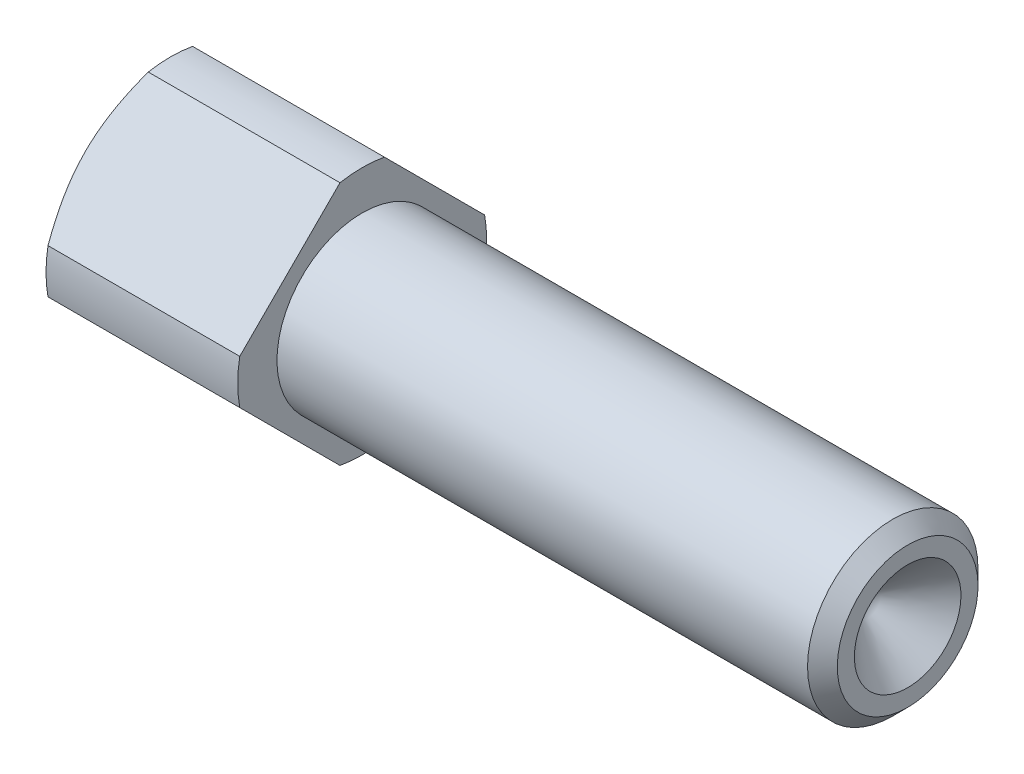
ISO-10303-21;
HEADER;
FILE_DESCRIPTION(('STEP AP214'),'2;1');
FILE_NAME('part.step','',(''),(''),'','','');
FILE_SCHEMA(('AUTOMOTIVE_DESIGN { 1 0 10303 214 1 1 1 1 }'));
ENDSEC;
DATA;
#1=APPLICATION_CONTEXT('core data for automotive mechanical design processes');
#2=APPLICATION_PROTOCOL_DEFINITION('international standard','automotive_design',2000,#1);
#3=PRODUCT_CONTEXT('',#1,'mechanical');
#4=PRODUCT('Part','Part','',(#3));
#5=PRODUCT_RELATED_PRODUCT_CATEGORY('part','',(#4));
#6=PRODUCT_DEFINITION_FORMATION('','',#4);
#7=PRODUCT_DEFINITION_CONTEXT('part definition',#1,'design');
#8=PRODUCT_DEFINITION('design','',#6,#7);
#9=PRODUCT_DEFINITION_SHAPE('','',#8);
#10=(LENGTH_UNIT() NAMED_UNIT(*) SI_UNIT(.MILLI.,.METRE.));
#11=(NAMED_UNIT(*) PLANE_ANGLE_UNIT() SI_UNIT($,.RADIAN.));
#12=(NAMED_UNIT(*) SI_UNIT($,.STERADIAN.) SOLID_ANGLE_UNIT());
#13=UNCERTAINTY_MEASURE_WITH_UNIT(LENGTH_MEASURE(1.E-05),#10,'distance_accuracy_value','');
#14=(GEOMETRIC_REPRESENTATION_CONTEXT(3) GLOBAL_UNCERTAINTY_ASSIGNED_CONTEXT((#13)) GLOBAL_UNIT_ASSIGNED_CONTEXT((#10,
#11,#12)) REPRESENTATION_CONTEXT('',''));
#15=CARTESIAN_POINT('',(0.,0.,0.));
#16=DIRECTION('',(0.,0.,1.));
#17=DIRECTION('',(1.,0.,0.));
#18=AXIS2_PLACEMENT_3D('',#15,#16,#17);
#19=CARTESIAN_POINT('',(6.,0.,0.));
#20=DIRECTION('',(1.,0.,0.));
#21=DIRECTION('',(0.,0.,-1.));
#22=AXIS2_PLACEMENT_3D('',#19,#20,#21);
#23=PLANE('',#22);
#24=CARTESIAN_POINT('',(6.,0.,0.));
#25=DIRECTION('',(1.,0.,0.));
#26=DIRECTION('',(0.,0.,-1.));
#27=AXIS2_PLACEMENT_3D('',#24,#25,#26);
#28=CIRCLE('',#27,3.65);
#29=CARTESIAN_POINT('',(6.,0.651201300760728,3.59143938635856));
#30=VERTEX_POINT('',#29);
#31=CARTESIAN_POINT('',(6.,-0.651201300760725,3.59143938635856));
#32=VERTEX_POINT('',#31);
#33=EDGE_CURVE('E268',#30,#32,#28,.T.);
#34=ORIENTED_EDGE('',*,*,#33,.T.);
#35=DIRECTION('',(0.,0.707106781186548,0.707106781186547));
#36=VECTOR('',#35,1.);
#37=CARTESIAN_POINT('',(6.,-4.24264068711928,0.));
#38=LINE('',#37,#36);
#39=CARTESIAN_POINT('',(6.,-3.59143938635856,0.651201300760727));
#40=VERTEX_POINT('',#39);
#41=EDGE_CURVE('E274',#40,#32,#38,.T.);
#42=ORIENTED_EDGE('',*,*,#41,.F.);
#43=CARTESIAN_POINT('',(6.,-3.59143938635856,-0.651201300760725));
#44=VERTEX_POINT('',#43);
#45=EDGE_CURVE('E264',#40,#44,#28,.T.);
#46=ORIENTED_EDGE('',*,*,#45,.T.);
#47=DIRECTION('',(0.,-0.707106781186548,0.707106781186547));
#48=VECTOR('',#47,1.);
#49=CARTESIAN_POINT('',(6.,0.,-4.24264068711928));
#50=LINE('',#49,#48);
#51=CARTESIAN_POINT('',(6.,-0.651201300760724,-3.59143938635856));
#52=VERTEX_POINT('',#51);
#53=EDGE_CURVE('E286',#52,#44,#50,.T.);
#54=ORIENTED_EDGE('',*,*,#53,.F.);
#55=CARTESIAN_POINT('',(6.,0.651201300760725,-3.59143938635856));
#56=VERTEX_POINT('',#55);
#57=EDGE_CURVE('E262',#52,#56,#28,.T.);
#58=ORIENTED_EDGE('',*,*,#57,.T.);
#59=DIRECTION('',(0.,-0.707106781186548,-0.707106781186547));
#60=VECTOR('',#59,1.);
#61=CARTESIAN_POINT('',(6.,4.24264068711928,0.));
#62=LINE('',#61,#60);
#63=CARTESIAN_POINT('',(6.,3.59143938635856,-0.651201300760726));
#64=VERTEX_POINT('',#63);
#65=EDGE_CURVE('E281',#64,#56,#62,.T.);
#66=ORIENTED_EDGE('',*,*,#65,.F.);
#67=CARTESIAN_POINT('',(6.,3.59143938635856,0.651201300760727));
#68=VERTEX_POINT('',#67);
#69=EDGE_CURVE('E241',#64,#68,#28,.T.);
#70=ORIENTED_EDGE('',*,*,#69,.T.);
#71=DIRECTION('',(0.,0.707106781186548,-0.707106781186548));
#72=VECTOR('',#71,1.);
#73=CARTESIAN_POINT('',(6.,0.,4.24264068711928));
#74=LINE('',#73,#72);
#75=EDGE_CURVE('E276',#30,#68,#74,.T.);
#76=ORIENTED_EDGE('',*,*,#75,.F.);
#77=EDGE_LOOP('',(#34,#42,#46,#54,#58,#66,#70,#76));
#78=FACE_BOUND('',#77,.T.);
#79=CARTESIAN_POINT('',(6.,0.,0.));
#80=DIRECTION('',(1.,0.,0.));
#81=DIRECTION('',(0.,1.,0.));
#82=AXIS2_PLACEMENT_3D('',#79,#80,#81);
#83=CIRCLE('',#82,2.5);
#84=CARTESIAN_POINT('',(6.,2.5,0.));
#85=VERTEX_POINT('',#84);
#86=EDGE_CURVE('E133',#85,#85,#83,.T.);
#87=ORIENTED_EDGE('',*,*,#86,.F.);
#88=EDGE_LOOP('',(#87));
#89=FACE_BOUND('',#88,.T.);
#90=ADVANCED_FACE('F44',(#78,#89),#23,.T.);
#91=CARTESIAN_POINT('',(6.,0.,0.));
#92=DIRECTION('',(-1.,0.,0.));
#93=DIRECTION('',(0.,0.,1.));
#94=AXIS2_PLACEMENT_3D('',#91,#92,#93);
#95=CYLINDRICAL_SURFACE('',#94,3.65);
#96=DIRECTION('',(-1.,0.,0.));
#97=VECTOR('',#96,1.);
#98=CARTESIAN_POINT('',(6.,0.651201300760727,3.59143938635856));
#99=LINE('',#98,#97);
#100=CARTESIAN_POINT('',(0.375277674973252,0.651201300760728,3.59143938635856));
#101=VERTEX_POINT('',#100);
#102=EDGE_CURVE('E250',#101,#30,#99,.F.);
#103=ORIENTED_EDGE('',*,*,#102,.F.);
#104=CARTESIAN_POINT('',(0.375277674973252,0.,0.));
#105=DIRECTION('',(1.,0.,0.));
#106=DIRECTION('',(0.,1.,0.));
#107=AXIS2_PLACEMENT_3D('',#104,#105,#106);
#108=CIRCLE('',#107,3.65);
#109=CARTESIAN_POINT('',(0.375277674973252,-0.651201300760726,3.59143938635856));
#110=VERTEX_POINT('',#109);
#111=EDGE_CURVE('E145',#101,#110,#108,.T.);
#112=ORIENTED_EDGE('',*,*,#111,.T.);
#113=DIRECTION('',(-1.,0.,0.));
#114=VECTOR('',#113,1.);
#115=CARTESIAN_POINT('',(6.,-0.651201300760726,3.59143938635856));
#116=LINE('',#115,#114);
#117=EDGE_CURVE('E260',#32,#110,#116,.T.);
#118=ORIENTED_EDGE('',*,*,#117,.F.);
#119=ORIENTED_EDGE('',*,*,#33,.F.);
#120=EDGE_LOOP('',(#103,#112,#118,#119));
#121=FACE_BOUND('',#120,.T.);
#122=ADVANCED_FACE('F214',(#121),#95,.T.);
#123=DIRECTION('',(-1.,0.,0.));
#124=VECTOR('',#123,1.);
#125=CARTESIAN_POINT('',(6.,-3.59143938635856,0.651201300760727));
#126=LINE('',#125,#124);
#127=CARTESIAN_POINT('',(0.375277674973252,-3.59143938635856,0.651201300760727));
#128=VERTEX_POINT('',#127);
#129=EDGE_CURVE('E258',#128,#40,#126,.F.);
#130=ORIENTED_EDGE('',*,*,#129,.F.);
#131=CARTESIAN_POINT('',(0.375277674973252,0.,0.));
#132=DIRECTION('',(1.,0.,0.));
#133=DIRECTION('',(0.,1.,0.));
#134=AXIS2_PLACEMENT_3D('',#131,#132,#133);
#135=CIRCLE('',#134,3.65);
#136=CARTESIAN_POINT('',(0.375277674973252,-3.59143938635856,-0.651201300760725));
#137=VERTEX_POINT('',#136);
#138=EDGE_CURVE('E141',#128,#137,#135,.T.);
#139=ORIENTED_EDGE('',*,*,#138,.T.);
#140=DIRECTION('',(-1.,0.,0.));
#141=VECTOR('',#140,1.);
#142=CARTESIAN_POINT('',(6.,-3.59143938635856,-0.651201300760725));
#143=LINE('',#142,#141);
#144=EDGE_CURVE('E255',#44,#137,#143,.T.);
#145=ORIENTED_EDGE('',*,*,#144,.F.);
#146=ORIENTED_EDGE('',*,*,#45,.F.);
#147=EDGE_LOOP('',(#130,#139,#145,#146));
#148=FACE_BOUND('',#147,.T.);
#149=ADVANCED_FACE('F220',(#148),#95,.T.);
#150=DIRECTION('',(-1.,0.,0.));
#151=VECTOR('',#150,1.);
#152=CARTESIAN_POINT('',(6.,-0.651201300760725,-3.59143938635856));
#153=LINE('',#152,#151);
#154=CARTESIAN_POINT('',(0.375277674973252,-0.651201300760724,-3.59143938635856));
#155=VERTEX_POINT('',#154);
#156=EDGE_CURVE('E248',#155,#52,#153,.F.);
#157=ORIENTED_EDGE('',*,*,#156,.F.);
#158=CARTESIAN_POINT('',(0.375277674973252,0.,0.));
#159=DIRECTION('',(1.,0.,0.));
#160=DIRECTION('',(0.,1.,0.));
#161=AXIS2_PLACEMENT_3D('',#158,#159,#160);
#162=CIRCLE('',#161,3.65);
#163=CARTESIAN_POINT('',(0.375277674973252,0.651201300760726,-3.59143938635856));
#164=VERTEX_POINT('',#163);
#165=EDGE_CURVE('E195',#155,#164,#162,.T.);
#166=ORIENTED_EDGE('',*,*,#165,.T.);
#167=DIRECTION('',(-1.,0.,0.));
#168=VECTOR('',#167,1.);
#169=CARTESIAN_POINT('',(6.,0.651201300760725,-3.59143938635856));
#170=LINE('',#169,#168);
#171=EDGE_CURVE('E244',#56,#164,#170,.T.);
#172=ORIENTED_EDGE('',*,*,#171,.F.);
#173=ORIENTED_EDGE('',*,*,#57,.F.);
#174=EDGE_LOOP('',(#157,#166,#172,#173));
#175=FACE_BOUND('',#174,.T.);
#176=ADVANCED_FACE('F225',(#175),#95,.T.);
#177=DIRECTION('',(-1.,0.,0.));
#178=VECTOR('',#177,1.);
#179=CARTESIAN_POINT('',(6.,3.59143938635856,-0.651201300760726));
#180=LINE('',#179,#178);
#181=CARTESIAN_POINT('',(0.375277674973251,3.59143938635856,-0.651201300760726));
#182=VERTEX_POINT('',#181);
#183=EDGE_CURVE('E237',#182,#64,#180,.F.);
#184=ORIENTED_EDGE('',*,*,#183,.F.);
#185=CARTESIAN_POINT('',(0.375277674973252,0.,0.));
#186=DIRECTION('',(1.,0.,0.));
#187=DIRECTION('',(0.,1.,0.));
#188=AXIS2_PLACEMENT_3D('',#185,#186,#187);
#189=CIRCLE('',#188,3.65);
#190=CARTESIAN_POINT('',(0.375277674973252,3.59143938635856,0.651201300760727));
#191=VERTEX_POINT('',#190);
#192=EDGE_CURVE('E196',#182,#191,#189,.T.);
#193=ORIENTED_EDGE('',*,*,#192,.T.);
#194=DIRECTION('',(-1.,0.,0.));
#195=VECTOR('',#194,1.);
#196=CARTESIAN_POINT('',(6.,3.59143938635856,0.651201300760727));
#197=LINE('',#196,#195);
#198=EDGE_CURVE('E245',#68,#191,#197,.T.);
#199=ORIENTED_EDGE('',*,*,#198,.F.);
#200=ORIENTED_EDGE('',*,*,#69,.F.);
#201=EDGE_LOOP('',(#184,#193,#199,#200));
#202=FACE_BOUND('',#201,.T.);
#203=ADVANCED_FACE('F205',(#202),#95,.T.);
#204=CARTESIAN_POINT('',(6.,0.,4.24264068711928));
#205=DIRECTION('',(0.,0.707106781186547,0.707106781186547));
#206=DIRECTION('',(0.,-0.707106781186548,0.707106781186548));
#207=AXIS2_PLACEMENT_3D('',#204,#205,#206);
#208=PLANE('',#207);
#209=CARTESIAN_POINT('',(0.375370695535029,0.651001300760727,3.59163938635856));
#210=CARTESIAN_POINT('',(0.323268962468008,0.763120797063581,3.4795198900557));
#211=CARTESIAN_POINT('',(0.274661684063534,0.876174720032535,3.36646596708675));
#212=CARTESIAN_POINT('',(0.186909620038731,1.10452820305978,3.13811248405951));
#213=CARTESIAN_POINT('',(0.147799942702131,1.21983444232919,3.0228062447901));
#214=CARTESIAN_POINT('',(0.0829033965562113,1.4488341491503,2.79380653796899));
#215=CARTESIAN_POINT('',(0.0567585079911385,1.56247530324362,2.68016538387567));
#216=CARTESIAN_POINT('',(0.0185374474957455,1.79078192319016,2.45185876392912));
#217=CARTESIAN_POINT('',(0.00643659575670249,1.90544523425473,2.33719545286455));
#218=CARTESIAN_POINT('',(-0.000588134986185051,2.08579182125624,2.15684886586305));
#219=CARTESIAN_POINT('',(-0.000652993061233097,2.15139124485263,2.09124944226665));
#220=CARTESIAN_POINT('',(0.00417098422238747,2.28250476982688,1.9601359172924));
#221=CARTESIAN_POINT('',(0.00906003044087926,2.34801886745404,1.89462181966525));
#222=CARTESIAN_POINT('',(0.0236362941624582,2.4789109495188,1.76372973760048));
#223=CARTESIAN_POINT('',(0.0333332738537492,2.54428838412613,1.69835230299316));
#224=CARTESIAN_POINT('',(0.0571990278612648,2.67463782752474,1.56800285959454));
#225=CARTESIAN_POINT('',(0.0713685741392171,2.73960976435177,1.50303092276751));
#226=CARTESIAN_POINT('',(0.121061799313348,2.93818256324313,1.30445812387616));
#227=CARTESIAN_POINT('',(0.163229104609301,3.07096692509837,1.17167376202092));
#228=CARTESIAN_POINT('',(0.2362538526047,3.26794686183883,0.974693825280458));
#229=CARTESIAN_POINT('',(0.262163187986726,3.3331132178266,0.909527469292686));
#230=CARTESIAN_POINT('',(0.316779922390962,3.46282259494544,0.77981809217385));
#231=CARTESIAN_POINT('',(0.345485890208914,3.52736591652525,0.715274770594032));
#232=CARTESIAN_POINT('',(0.375370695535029,3.59163938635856,0.651001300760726));
#233=B_SPLINE_CURVE_WITH_KNOTS('',3,(#209,#210,#211,#212,#213,#214,#215,#216,#217,#218,#219,
#220,#221,#222,#223,#224,#225,#226,#227,#228,#229,#230,#231,#232),.UNSPECIFIED.,.F.,.F.,(4,2,2,
2,2,2,2,2,2,2,2,4),(0.,0.500916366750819,1.0036571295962,1.49161120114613,1.97870647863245,
2.25690162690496,2.53510861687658,2.81388281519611,3.09270515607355,3.66932423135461,
3.95649300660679,4.24351558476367),.UNSPECIFIED.);
#234=CARTESIAN_POINT('',(0.,2.12132034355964,2.12132034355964));
#235=VERTEX_POINT('',#234);
#236=EDGE_CURVE('E157',#101,#235,#233,.T.);
#237=ORIENTED_EDGE('',*,*,#236,.F.);
#238=ORIENTED_EDGE('',*,*,#102,.T.);
#239=ORIENTED_EDGE('',*,*,#75,.T.);
#240=ORIENTED_EDGE('',*,*,#198,.T.);
#241=EDGE_CURVE('E283',#235,#191,#233,.T.);
#242=ORIENTED_EDGE('',*,*,#241,.F.);
#243=EDGE_LOOP('',(#237,#238,#239,#240,#242));
#244=FACE_BOUND('',#243,.T.);
#245=ADVANCED_FACE('F201',(#244),#208,.T.);
#246=CARTESIAN_POINT('',(6.,4.24264068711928,0.));
#247=DIRECTION('',(0.,0.707106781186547,-0.707106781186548));
#248=DIRECTION('',(0.,0.707106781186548,0.707106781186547));
#249=AXIS2_PLACEMENT_3D('',#246,#247,#248);
#250=PLANE('',#249);
#251=CARTESIAN_POINT('',(0.375370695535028,3.59163938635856,-0.651001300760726));
#252=CARTESIAN_POINT('',(0.323268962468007,3.47951989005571,-0.763120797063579));
#253=CARTESIAN_POINT('',(0.274661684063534,3.36646596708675,-0.876174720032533));
#254=CARTESIAN_POINT('',(0.18690962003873,3.13811248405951,-1.10452820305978));
#255=CARTESIAN_POINT('',(0.147799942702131,3.0228062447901,-1.21983444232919));
#256=CARTESIAN_POINT('',(0.082903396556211,2.79380653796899,-1.44883414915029));
#257=CARTESIAN_POINT('',(0.0567585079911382,2.68016538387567,-1.56247530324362));
#258=CARTESIAN_POINT('',(0.0185374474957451,2.45185876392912,-1.79078192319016));
#259=CARTESIAN_POINT('',(0.00643659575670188,2.33719545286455,-1.90544523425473));
#260=CARTESIAN_POINT('',(-0.000588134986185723,2.15684886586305,-2.08579182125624));
#261=CARTESIAN_POINT('',(-0.000652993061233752,2.09124944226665,-2.15139124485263));
#262=CARTESIAN_POINT('',(0.00417098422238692,1.9601359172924,-2.28250476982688));
#263=CARTESIAN_POINT('',(0.00906003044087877,1.89462181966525,-2.34801886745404));
#264=CARTESIAN_POINT('',(0.0236362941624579,1.76372973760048,-2.4789109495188));
#265=CARTESIAN_POINT('',(0.033333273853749,1.69835230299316,-2.54428838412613));
#266=CARTESIAN_POINT('',(0.0571990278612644,1.56800285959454,-2.67463782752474));
#267=CARTESIAN_POINT('',(0.0713685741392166,1.50303092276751,-2.73960976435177));
#268=CARTESIAN_POINT('',(0.121061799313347,1.30445812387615,-2.93818256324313));
#269=CARTESIAN_POINT('',(0.163229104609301,1.17167376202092,-3.07096692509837));
#270=CARTESIAN_POINT('',(0.236253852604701,0.974693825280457,-3.26794686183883));
#271=CARTESIAN_POINT('',(0.262163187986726,0.909527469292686,-3.3331132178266));
#272=CARTESIAN_POINT('',(0.316779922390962,0.779818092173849,-3.46282259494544));
#273=CARTESIAN_POINT('',(0.345485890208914,0.715274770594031,-3.52736591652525));
#274=CARTESIAN_POINT('',(0.375370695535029,0.651001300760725,-3.59163938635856));
#275=B_SPLINE_CURVE_WITH_KNOTS('',3,(#251,#252,#253,#254,#255,#256,#257,#258,#259,#260,#261,
#262,#263,#264,#265,#266,#267,#268,#269,#270,#271,#272,#273,#274),.UNSPECIFIED.,.F.,.F.,(4,2,2,
2,2,2,2,2,2,2,2,4),(0.,0.500916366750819,1.0036571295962,1.49161120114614,1.97870647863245,
2.25690162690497,2.53510861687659,2.81388281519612,3.09270515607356,3.66932423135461,
3.95649300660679,4.24351558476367),.UNSPECIFIED.);
#276=CARTESIAN_POINT('',(0.,2.12132034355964,-2.12132034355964));
#277=VERTEX_POINT('',#276);
#278=EDGE_CURVE('E194',#182,#277,#275,.T.);
#279=ORIENTED_EDGE('',*,*,#278,.F.);
#280=ORIENTED_EDGE('',*,*,#183,.T.);
#281=ORIENTED_EDGE('',*,*,#65,.T.);
#282=ORIENTED_EDGE('',*,*,#171,.T.);
#283=EDGE_CURVE('E188',#277,#164,#275,.T.);
#284=ORIENTED_EDGE('',*,*,#283,.F.);
#285=EDGE_LOOP('',(#279,#280,#281,#282,#284));
#286=FACE_BOUND('',#285,.T.);
#287=ADVANCED_FACE('F198',(#286),#250,.T.);
#288=CARTESIAN_POINT('',(6.,0.,-4.24264068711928));
#289=DIRECTION('',(0.,-0.707106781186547,-0.707106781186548));
#290=DIRECTION('',(0.,0.707106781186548,-0.707106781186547));
#291=AXIS2_PLACEMENT_3D('',#288,#289,#290);
#292=PLANE('',#291);
#293=CARTESIAN_POINT('',(0.375370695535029,-0.651001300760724,-3.59163938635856));
#294=CARTESIAN_POINT('',(0.323268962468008,-0.763120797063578,-3.47951989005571));
#295=CARTESIAN_POINT('',(0.274661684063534,-0.876174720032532,-3.36646596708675));
#296=CARTESIAN_POINT('',(0.186909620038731,-1.10452820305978,-3.13811248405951));
#297=CARTESIAN_POINT('',(0.147799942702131,-1.21983444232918,-3.0228062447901));
#298=CARTESIAN_POINT('',(0.0829033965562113,-1.44883414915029,-2.79380653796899));
#299=CARTESIAN_POINT('',(0.0567585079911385,-1.56247530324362,-2.68016538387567));
#300=CARTESIAN_POINT('',(0.0185374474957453,-1.79078192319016,-2.45185876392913));
#301=CARTESIAN_POINT('',(0.00643659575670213,-1.90544523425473,-2.33719545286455));
#302=CARTESIAN_POINT('',(-0.000588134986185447,-2.08579182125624,-2.15684886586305));
#303=CARTESIAN_POINT('',(-0.000652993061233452,-2.15139124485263,-2.09124944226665));
#304=CARTESIAN_POINT('',(0.00417098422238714,-2.28250476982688,-1.9601359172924));
#305=CARTESIAN_POINT('',(0.00906003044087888,-2.34801886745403,-1.89462181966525));
#306=CARTESIAN_POINT('',(0.0236362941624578,-2.4789109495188,-1.76372973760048));
#307=CARTESIAN_POINT('',(0.0333332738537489,-2.54428838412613,-1.69835230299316));
#308=CARTESIAN_POINT('',(0.0571990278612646,-2.67463782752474,-1.56800285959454));
#309=CARTESIAN_POINT('',(0.071368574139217,-2.73960976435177,-1.50303092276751));
#310=CARTESIAN_POINT('',(0.121061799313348,-2.93818256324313,-1.30445812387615));
#311=CARTESIAN_POINT('',(0.163229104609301,-3.07096692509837,-1.17167376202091));
#312=CARTESIAN_POINT('',(0.236253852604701,-3.26794686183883,-0.974693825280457));
#313=CARTESIAN_POINT('',(0.262163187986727,-3.3331132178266,-0.909527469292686));
#314=CARTESIAN_POINT('',(0.316779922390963,-3.46282259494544,-0.779818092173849));
#315=CARTESIAN_POINT('',(0.345485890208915,-3.52736591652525,-0.715274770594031));
#316=CARTESIAN_POINT('',(0.375370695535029,-3.59163938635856,-0.651001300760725));
#317=B_SPLINE_CURVE_WITH_KNOTS('',3,(#293,#294,#295,#296,#297,#298,#299,#300,#301,#302,#303,
#304,#305,#306,#307,#308,#309,#310,#311,#312,#313,#314,#315,#316),.UNSPECIFIED.,.F.,.F.,(4,2,2,
2,2,2,2,2,2,2,2,4),(0.,0.500916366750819,1.0036571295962,1.49161120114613,1.97870647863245,
2.25690162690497,2.53510861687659,2.81388281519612,3.09270515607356,3.66932423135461,
3.95649300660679,4.24351558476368),.UNSPECIFIED.);
#318=CARTESIAN_POINT('',(0.,-2.12132034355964,-2.12132034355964));
#319=VERTEX_POINT('',#318);
#320=EDGE_CURVE('E156',#155,#319,#317,.T.);
#321=ORIENTED_EDGE('',*,*,#320,.F.);
#322=ORIENTED_EDGE('',*,*,#156,.T.);
#323=ORIENTED_EDGE('',*,*,#53,.T.);
#324=ORIENTED_EDGE('',*,*,#144,.T.);
#325=EDGE_CURVE('E148',#319,#137,#317,.T.);
#326=ORIENTED_EDGE('',*,*,#325,.F.);
#327=EDGE_LOOP('',(#321,#322,#323,#324,#326));
#328=FACE_BOUND('',#327,.T.);
#329=ADVANCED_FACE('F164',(#328),#292,.T.);
#330=CARTESIAN_POINT('',(6.,-4.24264068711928,0.));
#331=DIRECTION('',(0.,-0.707106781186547,0.707106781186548));
#332=DIRECTION('',(0.,-0.707106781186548,-0.707106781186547));
#333=AXIS2_PLACEMENT_3D('',#330,#331,#332);
#334=PLANE('',#333);
#335=CARTESIAN_POINT('',(0.375370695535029,-3.59163938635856,0.651001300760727));
#336=CARTESIAN_POINT('',(0.323268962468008,-3.47951989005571,0.76312079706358));
#337=CARTESIAN_POINT('',(0.274661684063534,-3.36646596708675,0.876174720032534));
#338=CARTESIAN_POINT('',(0.186909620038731,-3.13811248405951,1.10452820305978));
#339=CARTESIAN_POINT('',(0.147799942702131,-3.0228062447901,1.21983444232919));
#340=CARTESIAN_POINT('',(0.0829033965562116,-2.79380653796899,1.44883414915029));
#341=CARTESIAN_POINT('',(0.056758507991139,-2.68016538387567,1.56247530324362));
#342=CARTESIAN_POINT('',(0.0185374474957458,-2.45185876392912,1.79078192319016));
#343=CARTESIAN_POINT('',(0.00643659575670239,-2.33719545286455,1.90544523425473));
#344=CARTESIAN_POINT('',(-0.000588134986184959,-2.15684886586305,2.08579182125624));
#345=CARTESIAN_POINT('',(-0.000652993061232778,-2.09124944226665,2.15139124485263));
#346=CARTESIAN_POINT('',(0.00417098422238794,-1.9601359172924,2.28250476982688));
#347=CARTESIAN_POINT('',(0.00906003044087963,-1.89462181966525,2.34801886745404));
#348=CARTESIAN_POINT('',(0.0236362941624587,-1.76372973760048,2.4789109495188));
#349=CARTESIAN_POINT('',(0.0333332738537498,-1.69835230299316,2.54428838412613));
#350=CARTESIAN_POINT('',(0.0571990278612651,-1.56800285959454,2.67463782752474));
#351=CARTESIAN_POINT('',(0.0713685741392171,-1.50303092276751,2.73960976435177));
#352=CARTESIAN_POINT('',(0.121061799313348,-1.30445812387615,2.93818256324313));
#353=CARTESIAN_POINT('',(0.163229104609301,-1.17167376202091,3.07096692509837));
#354=CARTESIAN_POINT('',(0.236253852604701,-0.974693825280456,3.26794686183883));
#355=CARTESIAN_POINT('',(0.262163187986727,-0.909527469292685,3.3331132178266));
#356=CARTESIAN_POINT('',(0.316779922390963,-0.779818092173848,3.46282259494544));
#357=CARTESIAN_POINT('',(0.345485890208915,-0.71527477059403,3.52736591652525));
#358=CARTESIAN_POINT('',(0.375370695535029,-0.651001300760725,3.59163938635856));
#359=B_SPLINE_CURVE_WITH_KNOTS('',3,(#335,#336,#337,#338,#339,#340,#341,#342,#343,#344,#345,
#346,#347,#348,#349,#350,#351,#352,#353,#354,#355,#356,#357,#358),.UNSPECIFIED.,.F.,.F.,(4,2,2,
2,2,2,2,2,2,2,2,4),(0.,0.500916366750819,1.0036571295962,1.49161120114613,1.97870647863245,
2.25690162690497,2.53510861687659,2.81388281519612,3.09270515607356,3.66932423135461,
3.95649300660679,4.24351558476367),.UNSPECIFIED.);
#360=CARTESIAN_POINT('',(0.,-2.12132034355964,2.12132034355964));
#361=VERTEX_POINT('',#360);
#362=EDGE_CURVE('E67',#128,#361,#359,.T.);
#363=ORIENTED_EDGE('',*,*,#362,.F.);
#364=ORIENTED_EDGE('',*,*,#129,.T.);
#365=ORIENTED_EDGE('',*,*,#41,.T.);
#366=ORIENTED_EDGE('',*,*,#117,.T.);
#367=EDGE_CURVE('E179',#361,#110,#359,.T.);
#368=ORIENTED_EDGE('',*,*,#367,.F.);
#369=EDGE_LOOP('',(#363,#364,#365,#366,#368));
#370=FACE_BOUND('',#369,.T.);
#371=ADVANCED_FACE('F207',(#370),#334,.T.);
#372=CARTESIAN_POINT('',(0.,0.,0.));
#373=DIRECTION('',(1.,0.,0.));
#374=DIRECTION('',(0.,1.,0.));
#375=AXIS2_PLACEMENT_3D('',#372,#373,#374);
#376=CONICAL_SURFACE('',#375,3.,1.0471975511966);
#377=ORIENTED_EDGE('',*,*,#236,.T.);
#378=CARTESIAN_POINT('',(0.,0.,0.));
#379=DIRECTION('',(1.,0.,0.));
#380=DIRECTION('',(0.,1.,0.));
#381=AXIS2_PLACEMENT_3D('',#378,#379,#380);
#382=CIRCLE('',#381,3.);
#383=EDGE_CURVE('E139',#235,#361,#382,.T.);
#384=ORIENTED_EDGE('',*,*,#383,.T.);
#385=ORIENTED_EDGE('',*,*,#367,.T.);
#386=ORIENTED_EDGE('',*,*,#111,.F.);
#387=EDGE_LOOP('',(#377,#384,#385,#386));
#388=FACE_BOUND('',#387,.T.);
#389=ADVANCED_FACE('F172',(#388),#376,.T.);
#390=ORIENTED_EDGE('',*,*,#325,.T.);
#391=ORIENTED_EDGE('',*,*,#138,.F.);
#392=ORIENTED_EDGE('',*,*,#362,.T.);
#393=EDGE_CURVE('E142',#361,#319,#382,.T.);
#394=ORIENTED_EDGE('',*,*,#393,.T.);
#395=EDGE_LOOP('',(#390,#391,#392,#394));
#396=FACE_BOUND('',#395,.T.);
#397=ADVANCED_FACE('F167',(#396),#376,.T.);
#398=ORIENTED_EDGE('',*,*,#283,.T.);
#399=ORIENTED_EDGE('',*,*,#165,.F.);
#400=ORIENTED_EDGE('',*,*,#320,.T.);
#401=EDGE_CURVE('E59',#319,#277,#382,.T.);
#402=ORIENTED_EDGE('',*,*,#401,.T.);
#403=EDGE_LOOP('',(#398,#399,#400,#402));
#404=FACE_BOUND('',#403,.T.);
#405=ADVANCED_FACE('F171',(#404),#376,.T.);
#406=ORIENTED_EDGE('',*,*,#278,.T.);
#407=EDGE_CURVE('E136',#277,#235,#382,.T.);
#408=ORIENTED_EDGE('',*,*,#407,.T.);
#409=ORIENTED_EDGE('',*,*,#241,.T.);
#410=ORIENTED_EDGE('',*,*,#192,.F.);
#411=EDGE_LOOP('',(#406,#408,#409,#410));
#412=FACE_BOUND('',#411,.T.);
#413=ADVANCED_FACE('F173',(#412),#376,.T.);
#414=CARTESIAN_POINT('',(0.,0.,0.));
#415=DIRECTION('',(1.,0.,0.));
#416=DIRECTION('',(0.,0.,-1.));
#417=AXIS2_PLACEMENT_3D('',#414,#415,#416);
#418=PLANE('',#417);
#419=ORIENTED_EDGE('',*,*,#401,.F.);
#420=ORIENTED_EDGE('',*,*,#393,.F.);
#421=ORIENTED_EDGE('',*,*,#383,.F.);
#422=ORIENTED_EDGE('',*,*,#407,.F.);
#423=EDGE_LOOP('',(#419,#420,#421,#422));
#424=FACE_BOUND('',#423,.T.);
#425=ADVANCED_FACE('F216',(#424),#418,.F.);
#426=CARTESIAN_POINT('',(14.0868030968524,0.,0.));
#427=DIRECTION('',(1.,0.,0.));
#428=DIRECTION('',(0.,1.,0.));
#429=AXIS2_PLACEMENT_3D('',#426,#427,#428);
#430=CYLINDRICAL_SURFACE('',#429,2.5);
#431=CARTESIAN_POINT('',(21.5633421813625,0.,0.));
#432=DIRECTION('',(-1.,0.,0.));
#433=DIRECTION('',(0.,-1.,0.));
#434=AXIS2_PLACEMENT_3D('',#431,#432,#433);
#435=CIRCLE('',#434,2.5);
#436=CARTESIAN_POINT('',(21.5633421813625,-2.5,0.));
#437=VERTEX_POINT('',#436);
#438=EDGE_CURVE('E12',#437,#437,#435,.T.);
#439=ORIENTED_EDGE('',*,*,#438,.T.);
#440=EDGE_LOOP('',(#439));
#441=FACE_BOUND('',#440,.T.);
#442=ORIENTED_EDGE('',*,*,#86,.T.);
#443=EDGE_LOOP('',(#442));
#444=FACE_BOUND('',#443,.T.);
#445=ADVANCED_FACE('F174',(#441,#444),#430,.T.);
#446=CARTESIAN_POINT('',(22.,-2.5,0.));
#447=DIRECTION('',(-1.,0.,0.));
#448=DIRECTION('',(0.,-1.,0.));
#449=AXIS2_PLACEMENT_3D('',#446,#447,#448);
#450=PLANE('',#449);
#451=CARTESIAN_POINT('',(22.,0.,0.));
#452=DIRECTION('',(-1.,0.,0.));
#453=DIRECTION('',(0.,-1.,0.));
#454=AXIS2_PLACEMENT_3D('',#451,#452,#453);
#455=CIRCLE('',#454,2.0633421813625);
#456=CARTESIAN_POINT('',(22.,-2.06334218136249,0.));
#457=VERTEX_POINT('',#456);
#458=EDGE_CURVE('E52',#457,#457,#455,.F.);
#459=ORIENTED_EDGE('',*,*,#458,.T.);
#460=EDGE_LOOP('',(#459));
#461=FACE_BOUND('',#460,.T.);
#462=CARTESIAN_POINT('',(22.,0.,0.));
#463=DIRECTION('',(1.,0.,0.));
#464=DIRECTION('',(0.,1.,0.));
#465=AXIS2_PLACEMENT_3D('',#462,#463,#464);
#466=CIRCLE('',#465,1.56334218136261);
#467=CARTESIAN_POINT('',(22.,1.56334218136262,0.));
#468=VERTEX_POINT('',#467);
#469=EDGE_CURVE('E131',#468,#468,#466,.T.);
#470=ORIENTED_EDGE('',*,*,#469,.F.);
#471=EDGE_LOOP('',(#470));
#472=FACE_BOUND('',#471,.T.);
#473=ADVANCED_FACE('F127',(#461,#472),#450,.F.);
#474=CARTESIAN_POINT('',(22.,0.,0.));
#475=DIRECTION('',(1.,0.,0.));
#476=DIRECTION('',(0.,1.,0.));
#477=AXIS2_PLACEMENT_3D('',#474,#475,#476);
#478=CONICAL_SURFACE('',#477,1.56334218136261,0.785398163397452);
#479=CARTESIAN_POINT('',(20.4366578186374,0.,0.));
#480=VERTEX_POINT('',#479);
#481=VERTEX_LOOP('',#480);
#482=FACE_BOUND('',#481,.T.);
#483=ORIENTED_EDGE('',*,*,#469,.T.);
#484=EDGE_LOOP('',(#483));
#485=FACE_BOUND('',#484,.T.);
#486=ADVANCED_FACE('F124',(#482,#485),#478,.F.);
#487=CARTESIAN_POINT('',(22.,0.,0.));
#488=DIRECTION('',(-1.,0.,0.));
#489=DIRECTION('',(0.,-1.,0.));
#490=AXIS2_PLACEMENT_3D('',#487,#488,#489);
#491=CONICAL_SURFACE('',#490,2.0633421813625,0.785398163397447);
#492=CARTESIAN_POINT('',(21.5633421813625,-2.5,0.));
#493=CARTESIAN_POINT('',(21.5678907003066,-2.49545148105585,0.));
#494=CARTESIAN_POINT('',(21.5724392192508,-2.49090296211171,0.));
#495=CARTESIAN_POINT('',(21.5815362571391,-2.48180592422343,0.));
#496=CARTESIAN_POINT('',(21.5860847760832,-2.47725740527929,0.));
#497=CARTESIAN_POINT('',(21.5951818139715,-2.46816036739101,0.));
#498=CARTESIAN_POINT('',(21.5997303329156,-2.46361184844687,0.));
#499=CARTESIAN_POINT('',(21.6088273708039,-2.45451481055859,0.));
#500=CARTESIAN_POINT('',(21.613375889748,-2.44996629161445,0.));
#501=CARTESIAN_POINT('',(21.6224729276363,-2.44086925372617,0.));
#502=CARTESIAN_POINT('',(21.6270214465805,-2.43632073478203,0.));
#503=CARTESIAN_POINT('',(21.6361184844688,-2.42722369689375,0.));
#504=CARTESIAN_POINT('',(21.6406670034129,-2.42267517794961,0.));
#505=CARTESIAN_POINT('',(21.6497640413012,-2.41357814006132,0.));
#506=CARTESIAN_POINT('',(21.6543125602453,-2.40902962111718,0.));
#507=CARTESIAN_POINT('',(21.6634095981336,-2.3999325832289,0.));
#508=CARTESIAN_POINT('',(21.6679581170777,-2.39538406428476,0.));
#509=CARTESIAN_POINT('',(21.677055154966,-2.38628702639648,0.));
#510=CARTESIAN_POINT('',(21.6816036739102,-2.38173850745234,0.));
#511=CARTESIAN_POINT('',(21.6907007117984,-2.37264146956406,0.));
#512=CARTESIAN_POINT('',(21.6952492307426,-2.36809295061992,0.));
#513=CARTESIAN_POINT('',(21.7043462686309,-2.35899591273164,0.));
#514=CARTESIAN_POINT('',(21.708894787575,-2.3544473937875,0.));
#515=CARTESIAN_POINT('',(21.7179918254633,-2.34535035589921,0.));
#516=CARTESIAN_POINT('',(21.7225403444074,-2.34080183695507,0.));
#517=CARTESIAN_POINT('',(21.7316373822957,-2.33170479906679,0.));
#518=CARTESIAN_POINT('',(21.7361859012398,-2.32715628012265,0.));
#519=CARTESIAN_POINT('',(21.7452829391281,-2.31805924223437,0.));
#520=CARTESIAN_POINT('',(21.7498314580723,-2.31351072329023,0.));
#521=CARTESIAN_POINT('',(21.7589284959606,-2.30441368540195,0.));
#522=CARTESIAN_POINT('',(21.7634770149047,-2.29986516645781,0.));
#523=CARTESIAN_POINT('',(21.772574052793,-2.29076812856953,0.));
#524=CARTESIAN_POINT('',(21.7771225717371,-2.28621960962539,0.));
#525=CARTESIAN_POINT('',(21.7862196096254,-2.2771225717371,0.));
#526=CARTESIAN_POINT('',(21.7907681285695,-2.27257405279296,0.));
#527=CARTESIAN_POINT('',(21.7998651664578,-2.26347701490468,0.));
#528=CARTESIAN_POINT('',(21.804413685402,-2.25892849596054,0.));
#529=CARTESIAN_POINT('',(21.8135107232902,-2.24983145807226,0.));
#530=CARTESIAN_POINT('',(21.8180592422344,-2.24528293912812,0.));
#531=CARTESIAN_POINT('',(21.8271562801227,-2.23618590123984,0.));
#532=CARTESIAN_POINT('',(21.8317047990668,-2.2316373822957,0.));
#533=CARTESIAN_POINT('',(21.8408018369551,-2.22254034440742,0.));
#534=CARTESIAN_POINT('',(21.8453503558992,-2.21799182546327,0.));
#535=CARTESIAN_POINT('',(21.8544473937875,-2.20889478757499,0.));
#536=CARTESIAN_POINT('',(21.8589959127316,-2.20434626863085,0.));
#537=CARTESIAN_POINT('',(21.8680929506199,-2.19524923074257,0.));
#538=CARTESIAN_POINT('',(21.8726414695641,-2.19070071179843,0.));
#539=CARTESIAN_POINT('',(21.8817385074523,-2.18160367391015,0.));
#540=CARTESIAN_POINT('',(21.8862870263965,-2.17705515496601,0.));
#541=CARTESIAN_POINT('',(21.8953840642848,-2.16795811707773,0.));
#542=CARTESIAN_POINT('',(21.8999325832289,-2.16340959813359,0.));
#543=CARTESIAN_POINT('',(21.9090296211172,-2.15431256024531,0.));
#544=CARTESIAN_POINT('',(21.9135781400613,-2.14976404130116,0.));
#545=CARTESIAN_POINT('',(21.9226751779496,-2.14066700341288,0.));
#546=CARTESIAN_POINT('',(21.9272236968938,-2.13611848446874,0.));
#547=CARTESIAN_POINT('',(21.936320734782,-2.12702144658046,0.));
#548=CARTESIAN_POINT('',(21.9408692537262,-2.12247292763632,0.));
#549=CARTESIAN_POINT('',(21.9499662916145,-2.11337588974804,0.));
#550=CARTESIAN_POINT('',(21.9545148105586,-2.1088273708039,0.));
#551=CARTESIAN_POINT('',(21.9636118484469,-2.09973033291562,0.));
#552=CARTESIAN_POINT('',(21.968160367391,-2.09518181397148,0.));
#553=CARTESIAN_POINT('',(21.9772574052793,-2.0860847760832,0.));
#554=CARTESIAN_POINT('',(21.9818059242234,-2.08153625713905,0.));
#555=CARTESIAN_POINT('',(21.9909029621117,-2.07243921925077,0.));
#556=CARTESIAN_POINT('',(21.9954514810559,-2.06789070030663,0.));
#557=CARTESIAN_POINT('',(22.,-2.06334218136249,0.));
#558=B_SPLINE_CURVE_WITH_KNOTS('',3,(#492,#493,#494,#495,#496,#497,#498,#499,#500,#501,#502,
#503,#504,#505,#506,#507,#508,#509,#510,#511,#512,#513,#514,#515,#516,#517,#518,#519,#520,#521,
#522,#523,#524,#525,#526,#527,#528,#529,#530,#531,#532,#533,#534,#535,#536,#537,#538,#539,#540,
#541,#542,#543,#544,#545,#546,#547,#548,#549,#550,#551,#552,#553,#554,#555,#556,#557),
.UNSPECIFIED.,.F.,.F.,(4,2,2,2,2,2,2,2,2,2,2,2,2,2,2,2,2,2,2,2,2,2,2,2,2,2,2,2,2,2,2,2,4),(0.,
0.0192977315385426,0.0385954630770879,0.0578931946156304,0.0771909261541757,0.0964886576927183,
0.115786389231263,0.135084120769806,0.154381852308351,0.173679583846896,0.192977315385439,
0.212275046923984,0.231572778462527,0.250870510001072,0.270168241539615,0.28946597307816,
0.308763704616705,0.328061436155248,0.347359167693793,0.366656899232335,0.38595463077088,
0.405252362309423,0.424550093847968,0.443847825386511,0.463145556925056,0.482443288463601,
0.501741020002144,0.521038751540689,0.540336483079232,0.559634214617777,0.578931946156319,
0.598229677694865,0.617527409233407),.UNSPECIFIED.);
#559=EDGE_CURVE('BSEAM46',#437,#457,#558,.T.);
#560=ORIENTED_EDGE('',*,*,#438,.F.);
#561=ORIENTED_EDGE('',*,*,#458,.F.);
#562=ORIENTED_EDGE('',*,*,#559,.T.);
#563=ORIENTED_EDGE('',*,*,#559,.F.);
#564=EDGE_LOOP('',(#560,#562,#561,#563));
#565=FACE_BOUND('',#564,.T.);
#566=ADVANCED_FACE('F46',(#565),#491,.T.);
#567=CLOSED_SHELL('',(#90,#122,#149,#176,#203,#245,#287,#329,#371,#389,#397,#405,#413,#425,#445,
#473,#486,#566));
#568=MANIFOLD_SOLID_BREP('B2',#567);
#569=ADVANCED_BREP_SHAPE_REPRESENTATION('',(#18,#568),#14);
#570=SHAPE_DEFINITION_REPRESENTATION(#9,#569);
ENDSEC;
END-ISO-10303-21;
